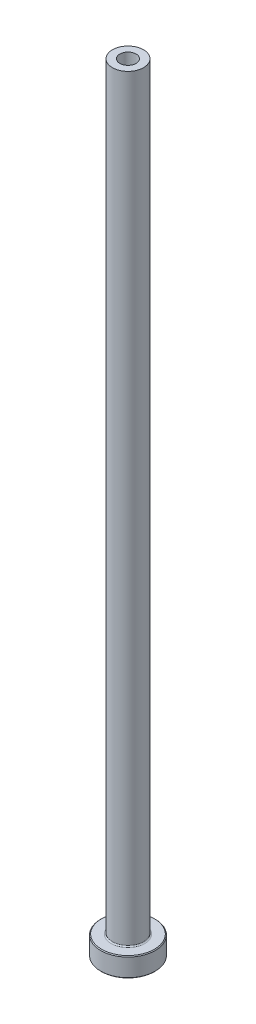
from build123d import *

# Parameters (mm, degrees)
FILLET1_R     = 0.3
CHAMFER1_SIZE = 0.2
CHAMFER3_SIZE = 0.5


with BuildPart() as part:
    # Sketch1 → Revolve1 (revolve)
    with BuildSketch(Plane.XY, mode=Mode.PRIVATE) as revolve1_sk:
        Polygon((-2.1, 200), (-4, 200), (-4, 5), (-7, 5), (-7, 0), (-2.35, 0), (-2.35, 143), (-2.1, 155), align=None)
    revolve(revolve1_sk.sketch.rotate(Axis((0, 92.187680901, 0), (0, -1, 0)), 270), axis=Axis((0, 92.187680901, 0), (0, -1, 0)))

    # Fillet1
    fillet1_edges = [part.edges().sort_by_distance(p)[0] for p in [
        (0, 5, -4),
    ]]
    fillet(fillet1_edges, radius=FILLET1_R)

    # Chamfer1
    chamfer1_edges = [part.edges().sort_by_distance(p)[0] for p in [
        (0, 0, -7),
        (0, 5, -7),
    ]]
    chamfer(chamfer1_edges, length=CHAMFER1_SIZE)

    # Chamfer3
    chamfer3_edges = [part.edges().sort_by_distance(p)[0] for p in [
        (0, 0, -2.35),
    ]]
    chamfer(chamfer3_edges, length=CHAMFER3_SIZE)


solid = part.part
